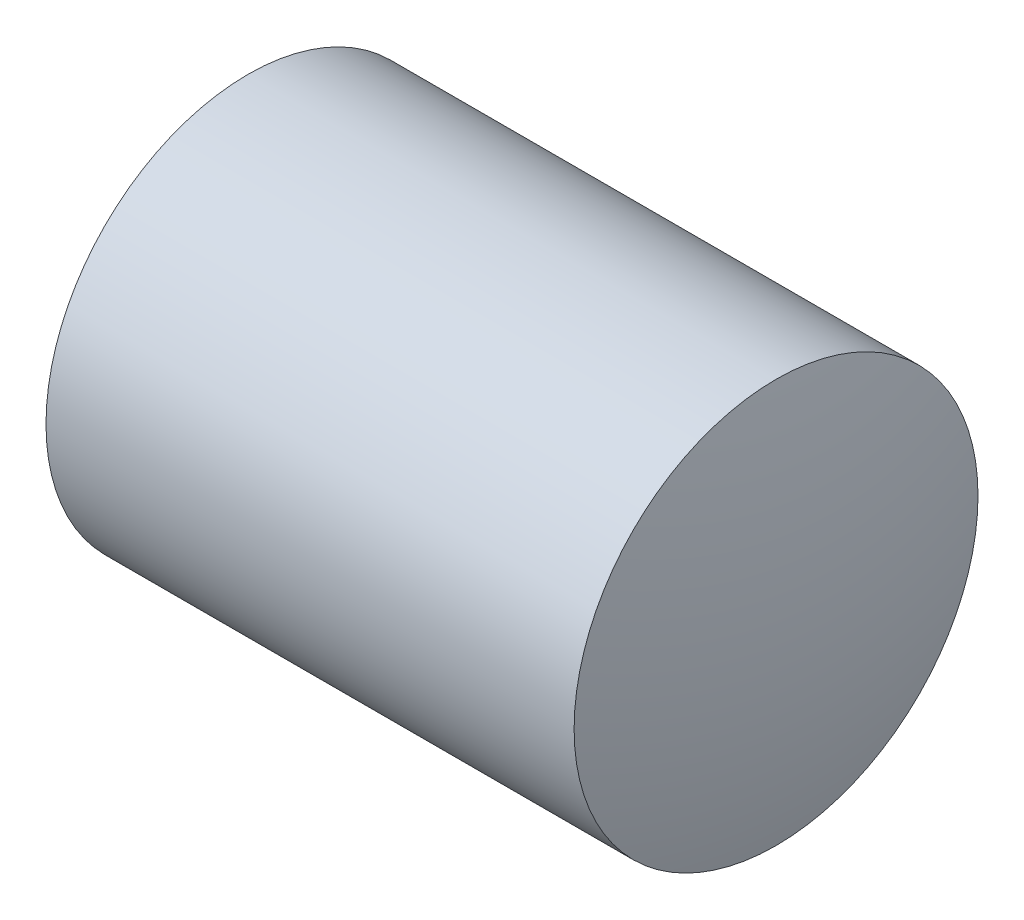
ISO-10303-21;
HEADER;
FILE_DESCRIPTION(('STEP AP214'),'2;1');
FILE_NAME('part.step','',(''),(''),'','','');
FILE_SCHEMA(('AUTOMOTIVE_DESIGN { 1 0 10303 214 1 1 1 1 }'));
ENDSEC;
DATA;
#1=APPLICATION_CONTEXT('core data for automotive mechanical design processes');
#2=APPLICATION_PROTOCOL_DEFINITION('international standard','automotive_design',2000,#1);
#3=PRODUCT_CONTEXT('',#1,'mechanical');
#4=PRODUCT('Part','Part','',(#3));
#5=PRODUCT_RELATED_PRODUCT_CATEGORY('part','',(#4));
#6=PRODUCT_DEFINITION_FORMATION('','',#4);
#7=PRODUCT_DEFINITION_CONTEXT('part definition',#1,'design');
#8=PRODUCT_DEFINITION('design','',#6,#7);
#9=PRODUCT_DEFINITION_SHAPE('','',#8);
#10=(LENGTH_UNIT() NAMED_UNIT(*) SI_UNIT(.MILLI.,.METRE.));
#11=(NAMED_UNIT(*) PLANE_ANGLE_UNIT() SI_UNIT($,.RADIAN.));
#12=(NAMED_UNIT(*) SI_UNIT($,.STERADIAN.) SOLID_ANGLE_UNIT());
#13=UNCERTAINTY_MEASURE_WITH_UNIT(LENGTH_MEASURE(1.E-05),#10,'distance_accuracy_value','');
#14=(GEOMETRIC_REPRESENTATION_CONTEXT(3) GLOBAL_UNCERTAINTY_ASSIGNED_CONTEXT((#13)) GLOBAL_UNIT_ASSIGNED_CONTEXT((#10,
#11,#12)) REPRESENTATION_CONTEXT('',''));
#15=CARTESIAN_POINT('',(0.,0.,0.));
#16=DIRECTION('',(0.,0.,1.));
#17=DIRECTION('',(1.,0.,0.));
#18=AXIS2_PLACEMENT_3D('',#15,#16,#17);
#19=CARTESIAN_POINT('',(12.715,0.,0.));
#20=DIRECTION('',(-1.,0.,0.));
#21=DIRECTION('',(0.,1.,0.));
#22=AXIS2_PLACEMENT_3D('',#19,#20,#21);
#23=SPHERICAL_SURFACE('',#22,11.94);
#24=CARTESIAN_POINT('',(24.2719719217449,0.,0.));
#25=DIRECTION('',(-1.,0.,0.));
#26=DIRECTION('',(0.,0.,1.));
#27=AXIS2_PLACEMENT_3D('',#24,#25,#26);
#28=CIRCLE('',#27,3.);
#29=CARTESIAN_POINT('',(24.2719719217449,0.,3.));
#30=VERTEX_POINT('',#29);
#31=EDGE_CURVE('E10',#30,#30,#28,.T.);
#32=ORIENTED_EDGE('',*,*,#31,.F.);
#33=EDGE_LOOP('',(#32));
#34=FACE_BOUND('',#33,.T.);
#35=ADVANCED_FACE('F31',(#34),#23,.T.);
#36=CARTESIAN_POINT('',(17.5,0.,0.));
#37=DIRECTION('',(-1.,0.,0.));
#38=DIRECTION('',(0.,0.,1.));
#39=AXIS2_PLACEMENT_3D('',#36,#37,#38);
#40=CYLINDRICAL_SURFACE('',#39,3.);
#41=CARTESIAN_POINT('',(16.4265159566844,0.,0.));
#42=DIRECTION('',(-1.,0.,0.));
#43=DIRECTION('',(0.,0.,1.));
#44=AXIS2_PLACEMENT_3D('',#41,#42,#43);
#45=CIRCLE('',#44,3.);
#46=CARTESIAN_POINT('',(16.4265159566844,0.,3.));
#47=VERTEX_POINT('',#46);
#48=EDGE_CURVE('E37',#47,#47,#45,.T.);
#49=ORIENTED_EDGE('',*,*,#48,.F.);
#50=EDGE_LOOP('',(#49));
#51=FACE_BOUND('',#50,.T.);
#52=ORIENTED_EDGE('',*,*,#31,.T.);
#53=EDGE_LOOP('',(#52));
#54=FACE_BOUND('',#53,.T.);
#55=ADVANCED_FACE('F45',(#51,#54),#40,.T.);
#56=CARTESIAN_POINT('',(12.7713,0.,0.));
#57=DIRECTION('',(-1.,0.,0.));
#58=DIRECTION('',(0.,1.,0.));
#59=AXIS2_PLACEMENT_3D('',#56,#57,#58);
#60=SPHERICAL_SURFACE('',#59,4.7287);
#61=ORIENTED_EDGE('',*,*,#48,.T.);
#62=EDGE_LOOP('',(#61));
#63=FACE_BOUND('',#62,.T.);
#64=ADVANCED_FACE('F43',(#63),#60,.F.);
#65=CLOSED_SHELL('',(#35,#55,#64));
#66=MANIFOLD_SOLID_BREP('B2',#65);
#67=ADVANCED_BREP_SHAPE_REPRESENTATION('',(#18,#66),#14);
#68=SHAPE_DEFINITION_REPRESENTATION(#9,#67);
ENDSEC;
END-ISO-10303-21;
